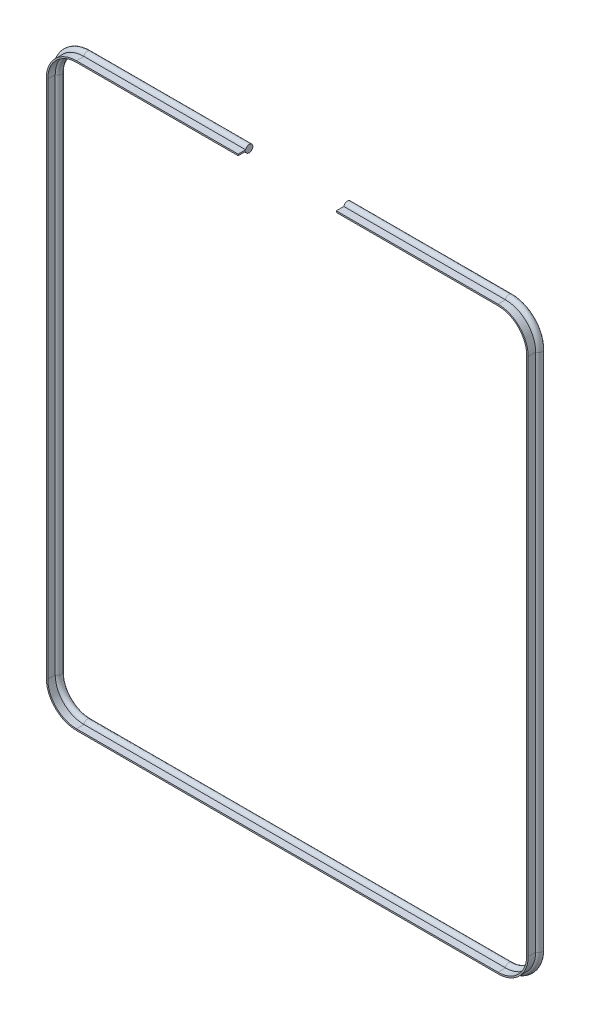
ISO-10303-21;
HEADER;
FILE_DESCRIPTION(('STEP AP214'),'2;1');
FILE_NAME('part.step','',(''),(''),'','','');
FILE_SCHEMA(('AUTOMOTIVE_DESIGN { 1 0 10303 214 1 1 1 1 }'));
ENDSEC;
DATA;
#1=APPLICATION_CONTEXT('core data for automotive mechanical design processes');
#2=APPLICATION_PROTOCOL_DEFINITION('international standard','automotive_design',2000,#1);
#3=PRODUCT_CONTEXT('',#1,'mechanical');
#4=PRODUCT('Part','Part','',(#3));
#5=PRODUCT_RELATED_PRODUCT_CATEGORY('part','',(#4));
#6=PRODUCT_DEFINITION_FORMATION('','',#4);
#7=PRODUCT_DEFINITION_CONTEXT('part definition',#1,'design');
#8=PRODUCT_DEFINITION('design','',#6,#7);
#9=PRODUCT_DEFINITION_SHAPE('','',#8);
#10=(LENGTH_UNIT() NAMED_UNIT(*) SI_UNIT(.MILLI.,.METRE.));
#11=(NAMED_UNIT(*) PLANE_ANGLE_UNIT() SI_UNIT($,.RADIAN.));
#12=(NAMED_UNIT(*) SI_UNIT($,.STERADIAN.) SOLID_ANGLE_UNIT());
#13=UNCERTAINTY_MEASURE_WITH_UNIT(LENGTH_MEASURE(1.E-05),#10,'distance_accuracy_value','');
#14=(GEOMETRIC_REPRESENTATION_CONTEXT(3) GLOBAL_UNCERTAINTY_ASSIGNED_CONTEXT((#13)) GLOBAL_UNIT_ASSIGNED_CONTEXT((#10,
#11,#12)) REPRESENTATION_CONTEXT('',''));
#15=CARTESIAN_POINT('',(0.,0.,0.));
#16=DIRECTION('',(0.,0.,1.));
#17=DIRECTION('',(1.,0.,0.));
#18=AXIS2_PLACEMENT_3D('',#15,#16,#17);
#19=CARTESIAN_POINT('',(429.5,-9.00000000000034,30.));
#20=DIRECTION('',(0.,-1.,0.));
#21=DIRECTION('',(1.,0.,0.));
#22=AXIS2_PLACEMENT_3D('',#19,#20,#21);
#23=PLANE('',#22);
#24=DIRECTION('',(0.,0.,1.));
#25=VECTOR('',#24,1.);
#26=CARTESIAN_POINT('',(429.5,-9.00000000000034,30.));
#27=LINE('',#26,#25);
#28=CARTESIAN_POINT('',(429.5,-9.00000000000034,14.8484692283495));
#29=VERTEX_POINT('',#28);
#30=CARTESIAN_POINT('',(429.5,-9.00000000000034,30.));
#31=VERTEX_POINT('',#30);
#32=EDGE_CURVE('E328',#29,#31,#27,.T.);
#33=ORIENTED_EDGE('',*,*,#32,.F.);
#34=DIRECTION('',(-1.,0.,0.));
#35=VECTOR('',#34,1.);
#36=CARTESIAN_POINT('',(429.5,-9.00000000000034,14.8484692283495));
#37=LINE('',#36,#35);
#38=CARTESIAN_POINT('',(100.,-9.00000000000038,14.8484692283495));
#39=VERTEX_POINT('',#38);
#40=EDGE_CURVE('E38',#29,#39,#37,.T.);
#41=ORIENTED_EDGE('',*,*,#40,.T.);
#42=DIRECTION('',(0.,0.,1.));
#43=VECTOR('',#42,1.);
#44=CARTESIAN_POINT('',(100.,-9.00000000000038,30.));
#45=LINE('',#44,#43);
#46=CARTESIAN_POINT('',(100.,-9.00000000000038,30.));
#47=VERTEX_POINT('',#46);
#48=EDGE_CURVE('E45',#39,#47,#45,.T.);
#49=ORIENTED_EDGE('',*,*,#48,.T.);
#50=DIRECTION('',(-1.,0.,0.));
#51=VECTOR('',#50,1.);
#52=CARTESIAN_POINT('',(429.5,-9.00000000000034,30.));
#53=LINE('',#52,#51);
#54=EDGE_CURVE('E11',#31,#47,#53,.T.);
#55=ORIENTED_EDGE('',*,*,#54,.F.);
#56=EDGE_LOOP('',(#33,#41,#49,#55));
#57=FACE_BOUND('',#56,.T.);
#58=ADVANCED_FACE('F31',(#57),#23,.F.);
#59=CARTESIAN_POINT('',(429.5,-10.5000000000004,7.5));
#60=DIRECTION('',(-1.,0.,0.));
#61=DIRECTION('',(0.,-1.,0.));
#62=AXIS2_PLACEMENT_3D('',#59,#60,#61);
#63=CYLINDRICAL_SURFACE('',#62,7.5);
#64=CARTESIAN_POINT('',(429.5,-10.5000000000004,7.5));
#65=DIRECTION('',(1.,0.,0.));
#66=DIRECTION('',(0.,0.,-1.));
#67=AXIS2_PLACEMENT_3D('',#64,#65,#66);
#68=CIRCLE('',#67,7.5);
#69=CARTESIAN_POINT('',(429.5,-12.0000000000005,14.8484692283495));
#70=VERTEX_POINT('',#69);
#71=EDGE_CURVE('E325',#70,#29,#68,.T.);
#72=ORIENTED_EDGE('',*,*,#71,.F.);
#73=DIRECTION('',(-1.,0.,0.));
#74=VECTOR('',#73,1.);
#75=CARTESIAN_POINT('',(429.5,-12.0000000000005,14.8484692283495));
#76=LINE('',#75,#74);
#77=CARTESIAN_POINT('',(100.,-12.0000000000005,14.8484692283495));
#78=VERTEX_POINT('',#77);
#79=EDGE_CURVE('E352',#70,#78,#76,.T.);
#80=ORIENTED_EDGE('',*,*,#79,.T.);
#81=CARTESIAN_POINT('',(100.,-10.5000000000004,7.5));
#82=DIRECTION('',(1.,0.,0.));
#83=DIRECTION('',(0.,0.,-1.));
#84=AXIS2_PLACEMENT_3D('',#81,#82,#83);
#85=CIRCLE('',#84,7.5);
#86=EDGE_CURVE('E53',#78,#39,#85,.T.);
#87=ORIENTED_EDGE('',*,*,#86,.T.);
#88=ORIENTED_EDGE('',*,*,#40,.F.);
#89=EDGE_LOOP('',(#72,#80,#87,#88));
#90=FACE_BOUND('',#89,.T.);
#91=ADVANCED_FACE('F355',(#90),#63,.T.);
#92=CARTESIAN_POINT('',(429.5,-12.0000000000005,30.));
#93=DIRECTION('',(0.,1.,0.));
#94=DIRECTION('',(-1.,0.,0.));
#95=AXIS2_PLACEMENT_3D('',#92,#93,#94);
#96=PLANE('',#95);
#97=DIRECTION('',(0.,0.,-1.));
#98=VECTOR('',#97,1.);
#99=CARTESIAN_POINT('',(429.5,-12.0000000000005,30.));
#100=LINE('',#99,#98);
#101=CARTESIAN_POINT('',(429.5,-12.0000000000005,30.));
#102=VERTEX_POINT('',#101);
#103=EDGE_CURVE('E322',#102,#70,#100,.T.);
#104=ORIENTED_EDGE('',*,*,#103,.F.);
#105=DIRECTION('',(-1.,0.,0.));
#106=VECTOR('',#105,1.);
#107=CARTESIAN_POINT('',(429.5,-12.0000000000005,30.));
#108=LINE('',#107,#106);
#109=CARTESIAN_POINT('',(100.,-12.0000000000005,30.));
#110=VERTEX_POINT('',#109);
#111=EDGE_CURVE('E349',#102,#110,#108,.T.);
#112=ORIENTED_EDGE('',*,*,#111,.T.);
#113=DIRECTION('',(0.,0.,-1.));
#114=VECTOR('',#113,1.);
#115=CARTESIAN_POINT('',(100.,-12.0000000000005,30.));
#116=LINE('',#115,#114);
#117=EDGE_CURVE('E345',#110,#78,#116,.T.);
#118=ORIENTED_EDGE('',*,*,#117,.T.);
#119=ORIENTED_EDGE('',*,*,#79,.F.);
#120=EDGE_LOOP('',(#104,#112,#118,#119));
#121=FACE_BOUND('',#120,.T.);
#122=ADVANCED_FACE('F439',(#121),#96,.F.);
#123=CARTESIAN_POINT('',(429.5,-70.5,7.5));
#124=DIRECTION('',(0.,0.,1.));
#125=DIRECTION('',(1.,0.,0.));
#126=AXIS2_PLACEMENT_3D('',#123,#124,#125);
#127=CYLINDRICAL_SURFACE('',#126,61.4999999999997);
#128=DIRECTION('',(0.,0.,1.));
#129=VECTOR('',#128,1.);
#130=CARTESIAN_POINT('',(491.,-70.5,30.));
#131=LINE('',#130,#129);
#132=CARTESIAN_POINT('',(491.,-70.5,14.8484692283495));
#133=VERTEX_POINT('',#132);
#134=CARTESIAN_POINT('',(491.,-70.5,30.));
#135=VERTEX_POINT('',#134);
#136=EDGE_CURVE('E307',#133,#135,#131,.T.);
#137=ORIENTED_EDGE('',*,*,#136,.F.);
#138=CARTESIAN_POINT('',(429.5,-70.5,14.8484692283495));
#139=DIRECTION('',(0.,0.,1.));
#140=DIRECTION('',(1.,0.,0.));
#141=AXIS2_PLACEMENT_3D('',#138,#139,#140);
#142=CIRCLE('',#141,61.4999999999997);
#143=EDGE_CURVE('E337',#133,#29,#142,.T.);
#144=ORIENTED_EDGE('',*,*,#143,.T.);
#145=ORIENTED_EDGE('',*,*,#32,.T.);
#146=CARTESIAN_POINT('',(429.5,-70.5,30.));
#147=DIRECTION('',(0.,0.,1.));
#148=DIRECTION('',(1.,0.,0.));
#149=AXIS2_PLACEMENT_3D('',#146,#147,#148);
#150=CIRCLE('',#149,61.4999999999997);
#151=EDGE_CURVE('E340',#135,#31,#150,.T.);
#152=ORIENTED_EDGE('',*,*,#151,.F.);
#153=EDGE_LOOP('',(#137,#144,#145,#152));
#154=FACE_BOUND('',#153,.T.);
#155=ADVANCED_FACE('F437',(#154),#127,.T.);
#156=CARTESIAN_POINT('',(429.5,-70.5,7.5));
#157=DIRECTION('',(0.,0.,1.));
#158=DIRECTION('',(1.,0.,0.));
#159=AXIS2_PLACEMENT_3D('',#156,#157,#158);
#160=TOROIDAL_SURFACE('',#159,59.9999999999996,7.5);
#161=CARTESIAN_POINT('',(489.5,-70.5,7.5));
#162=DIRECTION('',(0.,-1.,0.));
#163=DIRECTION('',(0.,0.,-1.));
#164=AXIS2_PLACEMENT_3D('',#161,#162,#163);
#165=CIRCLE('',#164,7.5);
#166=CARTESIAN_POINT('',(488.,-70.5,14.8484692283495));
#167=VERTEX_POINT('',#166);
#168=EDGE_CURVE('E304',#167,#133,#165,.T.);
#169=ORIENTED_EDGE('',*,*,#168,.F.);
#170=CARTESIAN_POINT('',(429.5,-70.5,14.8484692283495));
#171=DIRECTION('',(0.,0.,1.));
#172=DIRECTION('',(1.,0.,0.));
#173=AXIS2_PLACEMENT_3D('',#170,#171,#172);
#174=CIRCLE('',#173,58.4999999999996);
#175=EDGE_CURVE('E334',#167,#70,#174,.T.);
#176=ORIENTED_EDGE('',*,*,#175,.T.);
#177=ORIENTED_EDGE('',*,*,#71,.T.);
#178=ORIENTED_EDGE('',*,*,#143,.F.);
#179=EDGE_LOOP('',(#169,#176,#177,#178));
#180=FACE_BOUND('',#179,.T.);
#181=ADVANCED_FACE('F363',(#180),#160,.T.);
#182=CARTESIAN_POINT('',(429.5,-70.5,7.5));
#183=DIRECTION('',(0.,0.,1.));
#184=DIRECTION('',(1.,0.,0.));
#185=AXIS2_PLACEMENT_3D('',#182,#183,#184);
#186=CYLINDRICAL_SURFACE('',#185,58.4999999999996);
#187=DIRECTION('',(0.,0.,-1.));
#188=VECTOR('',#187,1.);
#189=CARTESIAN_POINT('',(488.,-70.5,30.));
#190=LINE('',#189,#188);
#191=CARTESIAN_POINT('',(488.,-70.5,30.));
#192=VERTEX_POINT('',#191);
#193=EDGE_CURVE('E301',#192,#167,#190,.T.);
#194=ORIENTED_EDGE('',*,*,#193,.F.);
#195=CARTESIAN_POINT('',(429.5,-70.5,30.));
#196=DIRECTION('',(0.,0.,1.));
#197=DIRECTION('',(1.,0.,0.));
#198=AXIS2_PLACEMENT_3D('',#195,#196,#197);
#199=CIRCLE('',#198,58.4999999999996);
#200=EDGE_CURVE('E331',#192,#102,#199,.T.);
#201=ORIENTED_EDGE('',*,*,#200,.T.);
#202=ORIENTED_EDGE('',*,*,#103,.T.);
#203=ORIENTED_EDGE('',*,*,#175,.F.);
#204=EDGE_LOOP('',(#194,#201,#202,#203));
#205=FACE_BOUND('',#204,.T.);
#206=ADVANCED_FACE('F360',(#205),#186,.F.);
#207=CARTESIAN_POINT('',(491.,-1129.5,30.));
#208=DIRECTION('',(-1.,0.,0.));
#209=DIRECTION('',(0.,0.,1.));
#210=AXIS2_PLACEMENT_3D('',#207,#208,#209);
#211=PLANE('',#210);
#212=DIRECTION('',(0.,0.,1.));
#213=VECTOR('',#212,1.);
#214=CARTESIAN_POINT('',(491.,-1129.5,30.));
#215=LINE('',#214,#213);
#216=CARTESIAN_POINT('',(491.,-1129.5,14.8484692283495));
#217=VERTEX_POINT('',#216);
#218=CARTESIAN_POINT('',(491.,-1129.5,30.));
#219=VERTEX_POINT('',#218);
#220=EDGE_CURVE('E286',#217,#219,#215,.T.);
#221=ORIENTED_EDGE('',*,*,#220,.F.);
#222=DIRECTION('',(0.,1.,0.));
#223=VECTOR('',#222,1.);
#224=CARTESIAN_POINT('',(491.,-1129.5,14.8484692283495));
#225=LINE('',#224,#223);
#226=EDGE_CURVE('E316',#217,#133,#225,.T.);
#227=ORIENTED_EDGE('',*,*,#226,.T.);
#228=ORIENTED_EDGE('',*,*,#136,.T.);
#229=DIRECTION('',(0.,1.,0.));
#230=VECTOR('',#229,1.);
#231=CARTESIAN_POINT('',(491.,-1129.5,30.));
#232=LINE('',#231,#230);
#233=EDGE_CURVE('E319',#219,#135,#232,.T.);
#234=ORIENTED_EDGE('',*,*,#233,.F.);
#235=EDGE_LOOP('',(#221,#227,#228,#234));
#236=FACE_BOUND('',#235,.T.);
#237=ADVANCED_FACE('F435',(#236),#211,.F.);
#238=CARTESIAN_POINT('',(489.5,-1129.5,7.5));
#239=DIRECTION('',(0.,1.,0.));
#240=DIRECTION('',(0.,0.,1.));
#241=AXIS2_PLACEMENT_3D('',#238,#239,#240);
#242=CYLINDRICAL_SURFACE('',#241,7.5);
#243=CARTESIAN_POINT('',(489.5,-1129.5,7.5));
#244=DIRECTION('',(0.,-1.,0.));
#245=DIRECTION('',(0.,0.,-1.));
#246=AXIS2_PLACEMENT_3D('',#243,#244,#245);
#247=CIRCLE('',#246,7.5);
#248=CARTESIAN_POINT('',(488.,-1129.5,14.8484692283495));
#249=VERTEX_POINT('',#248);
#250=EDGE_CURVE('E283',#249,#217,#247,.T.);
#251=ORIENTED_EDGE('',*,*,#250,.F.);
#252=DIRECTION('',(0.,1.,0.));
#253=VECTOR('',#252,1.);
#254=CARTESIAN_POINT('',(488.,-1129.5,14.8484692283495));
#255=LINE('',#254,#253);
#256=EDGE_CURVE('E313',#249,#167,#255,.T.);
#257=ORIENTED_EDGE('',*,*,#256,.T.);
#258=ORIENTED_EDGE('',*,*,#168,.T.);
#259=ORIENTED_EDGE('',*,*,#226,.F.);
#260=EDGE_LOOP('',(#251,#257,#258,#259));
#261=FACE_BOUND('',#260,.T.);
#262=ADVANCED_FACE('F370',(#261),#242,.T.);
#263=CARTESIAN_POINT('',(488.,-1129.5,30.));
#264=DIRECTION('',(1.,0.,0.));
#265=DIRECTION('',(0.,0.,-1.));
#266=AXIS2_PLACEMENT_3D('',#263,#264,#265);
#267=PLANE('',#266);
#268=DIRECTION('',(0.,0.,-1.));
#269=VECTOR('',#268,1.);
#270=CARTESIAN_POINT('',(488.,-1129.5,30.));
#271=LINE('',#270,#269);
#272=CARTESIAN_POINT('',(488.,-1129.5,30.));
#273=VERTEX_POINT('',#272);
#274=EDGE_CURVE('E280',#273,#249,#271,.T.);
#275=ORIENTED_EDGE('',*,*,#274,.F.);
#276=DIRECTION('',(0.,1.,0.));
#277=VECTOR('',#276,1.);
#278=CARTESIAN_POINT('',(488.,-1129.5,30.));
#279=LINE('',#278,#277);
#280=EDGE_CURVE('E310',#273,#192,#279,.T.);
#281=ORIENTED_EDGE('',*,*,#280,.T.);
#282=ORIENTED_EDGE('',*,*,#193,.T.);
#283=ORIENTED_EDGE('',*,*,#256,.F.);
#284=EDGE_LOOP('',(#275,#281,#282,#283));
#285=FACE_BOUND('',#284,.T.);
#286=ADVANCED_FACE('F368',(#285),#267,.F.);
#287=CARTESIAN_POINT('',(429.5,-1129.5,7.5));
#288=DIRECTION('',(0.,0.,1.));
#289=DIRECTION('',(1.,0.,0.));
#290=AXIS2_PLACEMENT_3D('',#287,#288,#289);
#291=CYLINDRICAL_SURFACE('',#290,61.4999999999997);
#292=DIRECTION('',(0.,0.,1.));
#293=VECTOR('',#292,1.);
#294=CARTESIAN_POINT('',(429.5,-1191.,30.));
#295=LINE('',#294,#293);
#296=CARTESIAN_POINT('',(429.5,-1191.,14.8484692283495));
#297=VERTEX_POINT('',#296);
#298=CARTESIAN_POINT('',(429.5,-1191.,30.));
#299=VERTEX_POINT('',#298);
#300=EDGE_CURVE('E265',#297,#299,#295,.T.);
#301=ORIENTED_EDGE('',*,*,#300,.F.);
#302=CARTESIAN_POINT('',(429.5,-1129.5,14.8484692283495));
#303=DIRECTION('',(0.,0.,1.));
#304=DIRECTION('',(1.,0.,0.));
#305=AXIS2_PLACEMENT_3D('',#302,#303,#304);
#306=CIRCLE('',#305,61.4999999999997);
#307=EDGE_CURVE('E295',#297,#217,#306,.T.);
#308=ORIENTED_EDGE('',*,*,#307,.T.);
#309=ORIENTED_EDGE('',*,*,#220,.T.);
#310=CARTESIAN_POINT('',(429.5,-1129.5,30.));
#311=DIRECTION('',(0.,0.,1.));
#312=DIRECTION('',(1.,0.,0.));
#313=AXIS2_PLACEMENT_3D('',#310,#311,#312);
#314=CIRCLE('',#313,61.4999999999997);
#315=EDGE_CURVE('E298',#299,#219,#314,.T.);
#316=ORIENTED_EDGE('',*,*,#315,.F.);
#317=EDGE_LOOP('',(#301,#308,#309,#316));
#318=FACE_BOUND('',#317,.T.);
#319=ADVANCED_FACE('F433',(#318),#291,.T.);
#320=CARTESIAN_POINT('',(429.5,-1129.5,7.5));
#321=DIRECTION('',(0.,0.,1.));
#322=DIRECTION('',(1.,0.,0.));
#323=AXIS2_PLACEMENT_3D('',#320,#321,#322);
#324=TOROIDAL_SURFACE('',#323,59.9999999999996,7.5);
#325=CARTESIAN_POINT('',(429.5,-1189.5,7.5));
#326=DIRECTION('',(-1.,0.,0.));
#327=DIRECTION('',(0.,0.,-1.));
#328=AXIS2_PLACEMENT_3D('',#325,#326,#327);
#329=CIRCLE('',#328,7.5);
#330=CARTESIAN_POINT('',(429.5,-1188.,14.8484692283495));
#331=VERTEX_POINT('',#330);
#332=EDGE_CURVE('E262',#331,#297,#329,.T.);
#333=ORIENTED_EDGE('',*,*,#332,.F.);
#334=CARTESIAN_POINT('',(429.5,-1129.5,14.8484692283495));
#335=DIRECTION('',(0.,0.,1.));
#336=DIRECTION('',(1.,0.,0.));
#337=AXIS2_PLACEMENT_3D('',#334,#335,#336);
#338=CIRCLE('',#337,58.4999999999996);
#339=EDGE_CURVE('E292',#331,#249,#338,.T.);
#340=ORIENTED_EDGE('',*,*,#339,.T.);
#341=ORIENTED_EDGE('',*,*,#250,.T.);
#342=ORIENTED_EDGE('',*,*,#307,.F.);
#343=EDGE_LOOP('',(#333,#340,#341,#342));
#344=FACE_BOUND('',#343,.T.);
#345=ADVANCED_FACE('F377',(#344),#324,.T.);
#346=CARTESIAN_POINT('',(429.5,-1129.5,7.5));
#347=DIRECTION('',(0.,0.,1.));
#348=DIRECTION('',(1.,0.,0.));
#349=AXIS2_PLACEMENT_3D('',#346,#347,#348);
#350=CYLINDRICAL_SURFACE('',#349,58.4999999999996);
#351=DIRECTION('',(0.,0.,-1.));
#352=VECTOR('',#351,1.);
#353=CARTESIAN_POINT('',(429.5,-1188.,30.));
#354=LINE('',#353,#352);
#355=CARTESIAN_POINT('',(429.5,-1188.,30.));
#356=VERTEX_POINT('',#355);
#357=EDGE_CURVE('E259',#356,#331,#354,.T.);
#358=ORIENTED_EDGE('',*,*,#357,.F.);
#359=CARTESIAN_POINT('',(429.5,-1129.5,30.));
#360=DIRECTION('',(0.,0.,1.));
#361=DIRECTION('',(1.,0.,0.));
#362=AXIS2_PLACEMENT_3D('',#359,#360,#361);
#363=CIRCLE('',#362,58.4999999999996);
#364=EDGE_CURVE('E289',#356,#273,#363,.T.);
#365=ORIENTED_EDGE('',*,*,#364,.T.);
#366=ORIENTED_EDGE('',*,*,#274,.T.);
#367=ORIENTED_EDGE('',*,*,#339,.F.);
#368=EDGE_LOOP('',(#358,#365,#366,#367));
#369=FACE_BOUND('',#368,.T.);
#370=ADVANCED_FACE('F375',(#369),#350,.F.);
#371=CARTESIAN_POINT('',(-429.5,-1191.,30.));
#372=DIRECTION('',(0.,1.,0.));
#373=DIRECTION('',(-1.,0.,0.));
#374=AXIS2_PLACEMENT_3D('',#371,#372,#373);
#375=PLANE('',#374);
#376=DIRECTION('',(0.,0.,1.));
#377=VECTOR('',#376,1.);
#378=CARTESIAN_POINT('',(-429.5,-1191.,30.));
#379=LINE('',#378,#377);
#380=CARTESIAN_POINT('',(-429.5,-1191.,14.8484692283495));
#381=VERTEX_POINT('',#380);
#382=CARTESIAN_POINT('',(-429.5,-1191.,30.));
#383=VERTEX_POINT('',#382);
#384=EDGE_CURVE('E244',#381,#383,#379,.T.);
#385=ORIENTED_EDGE('',*,*,#384,.F.);
#386=DIRECTION('',(1.,0.,0.));
#387=VECTOR('',#386,1.);
#388=CARTESIAN_POINT('',(-429.5,-1191.,14.8484692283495));
#389=LINE('',#388,#387);
#390=EDGE_CURVE('E274',#381,#297,#389,.T.);
#391=ORIENTED_EDGE('',*,*,#390,.T.);
#392=ORIENTED_EDGE('',*,*,#300,.T.);
#393=DIRECTION('',(1.,0.,0.));
#394=VECTOR('',#393,1.);
#395=CARTESIAN_POINT('',(-429.5,-1191.,30.));
#396=LINE('',#395,#394);
#397=EDGE_CURVE('E277',#383,#299,#396,.T.);
#398=ORIENTED_EDGE('',*,*,#397,.F.);
#399=EDGE_LOOP('',(#385,#391,#392,#398));
#400=FACE_BOUND('',#399,.T.);
#401=ADVANCED_FACE('F431',(#400),#375,.F.);
#402=CARTESIAN_POINT('',(-429.5,-1189.5,7.5));
#403=DIRECTION('',(1.,0.,0.));
#404=DIRECTION('',(0.,1.,0.));
#405=AXIS2_PLACEMENT_3D('',#402,#403,#404);
#406=CYLINDRICAL_SURFACE('',#405,7.5);
#407=CARTESIAN_POINT('',(-429.5,-1189.5,7.5));
#408=DIRECTION('',(-1.,0.,0.));
#409=DIRECTION('',(0.,0.,-1.));
#410=AXIS2_PLACEMENT_3D('',#407,#408,#409);
#411=CIRCLE('',#410,7.5);
#412=CARTESIAN_POINT('',(-429.5,-1188.,14.8484692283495));
#413=VERTEX_POINT('',#412);
#414=EDGE_CURVE('E241',#413,#381,#411,.T.);
#415=ORIENTED_EDGE('',*,*,#414,.F.);
#416=DIRECTION('',(1.,0.,0.));
#417=VECTOR('',#416,1.);
#418=CARTESIAN_POINT('',(-429.5,-1188.,14.8484692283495));
#419=LINE('',#418,#417);
#420=EDGE_CURVE('E271',#413,#331,#419,.T.);
#421=ORIENTED_EDGE('',*,*,#420,.T.);
#422=ORIENTED_EDGE('',*,*,#332,.T.);
#423=ORIENTED_EDGE('',*,*,#390,.F.);
#424=EDGE_LOOP('',(#415,#421,#422,#423));
#425=FACE_BOUND('',#424,.T.);
#426=ADVANCED_FACE('F384',(#425),#406,.T.);
#427=CARTESIAN_POINT('',(-429.5,-1188.,30.));
#428=DIRECTION('',(0.,-1.,0.));
#429=DIRECTION('',(1.,0.,0.));
#430=AXIS2_PLACEMENT_3D('',#427,#428,#429);
#431=PLANE('',#430);
#432=DIRECTION('',(0.,0.,-1.));
#433=VECTOR('',#432,1.);
#434=CARTESIAN_POINT('',(-429.5,-1188.,30.));
#435=LINE('',#434,#433);
#436=CARTESIAN_POINT('',(-429.5,-1188.,30.));
#437=VERTEX_POINT('',#436);
#438=EDGE_CURVE('E238',#437,#413,#435,.T.);
#439=ORIENTED_EDGE('',*,*,#438,.F.);
#440=DIRECTION('',(1.,0.,0.));
#441=VECTOR('',#440,1.);
#442=CARTESIAN_POINT('',(-429.5,-1188.,30.));
#443=LINE('',#442,#441);
#444=EDGE_CURVE('E268',#437,#356,#443,.T.);
#445=ORIENTED_EDGE('',*,*,#444,.T.);
#446=ORIENTED_EDGE('',*,*,#357,.T.);
#447=ORIENTED_EDGE('',*,*,#420,.F.);
#448=EDGE_LOOP('',(#439,#445,#446,#447));
#449=FACE_BOUND('',#448,.T.);
#450=ADVANCED_FACE('F382',(#449),#431,.F.);
#451=CARTESIAN_POINT('',(-429.5,-1129.5,7.5));
#452=DIRECTION('',(0.,0.,1.));
#453=DIRECTION('',(1.,0.,0.));
#454=AXIS2_PLACEMENT_3D('',#451,#452,#453);
#455=CYLINDRICAL_SURFACE('',#454,61.5);
#456=DIRECTION('',(0.,0.,1.));
#457=VECTOR('',#456,1.);
#458=CARTESIAN_POINT('',(-491.,-1129.5,30.));
#459=LINE('',#458,#457);
#460=CARTESIAN_POINT('',(-491.,-1129.5,14.8484692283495));
#461=VERTEX_POINT('',#460);
#462=CARTESIAN_POINT('',(-491.,-1129.5,30.));
#463=VERTEX_POINT('',#462);
#464=EDGE_CURVE('E225',#461,#463,#459,.T.);
#465=ORIENTED_EDGE('',*,*,#464,.F.);
#466=CARTESIAN_POINT('',(-429.5,-1129.5,14.8484692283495));
#467=DIRECTION('',(0.,0.,1.));
#468=DIRECTION('',(1.,0.,0.));
#469=AXIS2_PLACEMENT_3D('',#466,#467,#468);
#470=CIRCLE('',#469,61.5);
#471=EDGE_CURVE('E253',#461,#381,#470,.T.);
#472=ORIENTED_EDGE('',*,*,#471,.T.);
#473=ORIENTED_EDGE('',*,*,#384,.T.);
#474=CARTESIAN_POINT('',(-429.5,-1129.5,30.));
#475=DIRECTION('',(0.,0.,1.));
#476=DIRECTION('',(1.,0.,0.));
#477=AXIS2_PLACEMENT_3D('',#474,#475,#476);
#478=CIRCLE('',#477,61.5);
#479=EDGE_CURVE('E256',#463,#383,#478,.T.);
#480=ORIENTED_EDGE('',*,*,#479,.F.);
#481=EDGE_LOOP('',(#465,#472,#473,#480));
#482=FACE_BOUND('',#481,.T.);
#483=ADVANCED_FACE('F429',(#482),#455,.T.);
#484=CARTESIAN_POINT('',(-429.5,-1129.5,7.5));
#485=DIRECTION('',(0.,0.,1.));
#486=DIRECTION('',(1.,0.,0.));
#487=AXIS2_PLACEMENT_3D('',#484,#485,#486);
#488=TOROIDAL_SURFACE('',#487,60.,7.5);
#489=CARTESIAN_POINT('',(-489.5,-1129.5,7.5));
#490=DIRECTION('',(0.,1.,0.));
#491=DIRECTION('',(0.,0.,-1.));
#492=AXIS2_PLACEMENT_3D('',#489,#490,#491);
#493=CIRCLE('',#492,7.5);
#494=CARTESIAN_POINT('',(-488.,-1129.5,14.8484692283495));
#495=VERTEX_POINT('',#494);
#496=EDGE_CURVE('E222',#495,#461,#493,.T.);
#497=ORIENTED_EDGE('',*,*,#496,.F.);
#498=CARTESIAN_POINT('',(-429.5,-1129.5,14.8484692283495));
#499=DIRECTION('',(0.,0.,1.));
#500=DIRECTION('',(1.,0.,0.));
#501=AXIS2_PLACEMENT_3D('',#498,#499,#500);
#502=CIRCLE('',#501,58.5);
#503=EDGE_CURVE('E250',#495,#413,#502,.T.);
#504=ORIENTED_EDGE('',*,*,#503,.T.);
#505=ORIENTED_EDGE('',*,*,#414,.T.);
#506=ORIENTED_EDGE('',*,*,#471,.F.);
#507=EDGE_LOOP('',(#497,#504,#505,#506));
#508=FACE_BOUND('',#507,.T.);
#509=ADVANCED_FACE('F391',(#508),#488,.T.);
#510=CARTESIAN_POINT('',(-429.5,-1129.5,7.5));
#511=DIRECTION('',(0.,0.,1.));
#512=DIRECTION('',(1.,0.,0.));
#513=AXIS2_PLACEMENT_3D('',#510,#511,#512);
#514=CYLINDRICAL_SURFACE('',#513,58.5);
#515=DIRECTION('',(0.,0.,-1.));
#516=VECTOR('',#515,1.);
#517=CARTESIAN_POINT('',(-488.,-1129.5,30.));
#518=LINE('',#517,#516);
#519=CARTESIAN_POINT('',(-488.,-1129.5,30.));
#520=VERTEX_POINT('',#519);
#521=EDGE_CURVE('E219',#520,#495,#518,.T.);
#522=ORIENTED_EDGE('',*,*,#521,.F.);
#523=CARTESIAN_POINT('',(-429.5,-1129.5,30.));
#524=DIRECTION('',(0.,0.,1.));
#525=DIRECTION('',(1.,0.,0.));
#526=AXIS2_PLACEMENT_3D('',#523,#524,#525);
#527=CIRCLE('',#526,58.5);
#528=EDGE_CURVE('E247',#520,#437,#527,.T.);
#529=ORIENTED_EDGE('',*,*,#528,.T.);
#530=ORIENTED_EDGE('',*,*,#438,.T.);
#531=ORIENTED_EDGE('',*,*,#503,.F.);
#532=EDGE_LOOP('',(#522,#529,#530,#531));
#533=FACE_BOUND('',#532,.T.);
#534=ADVANCED_FACE('F389',(#533),#514,.F.);
#535=CARTESIAN_POINT('',(-491.,-70.5000000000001,30.));
#536=DIRECTION('',(1.,0.,0.));
#537=DIRECTION('',(0.,1.,0.));
#538=AXIS2_PLACEMENT_3D('',#535,#536,#537);
#539=PLANE('',#538);
#540=DIRECTION('',(0.,0.,1.));
#541=VECTOR('',#540,1.);
#542=CARTESIAN_POINT('',(-491.,-70.5000000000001,30.));
#543=LINE('',#542,#541);
#544=CARTESIAN_POINT('',(-491.,-70.5000000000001,14.8484692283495));
#545=VERTEX_POINT('',#544);
#546=CARTESIAN_POINT('',(-491.,-70.5000000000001,30.));
#547=VERTEX_POINT('',#546);
#548=EDGE_CURVE('E180',#545,#547,#543,.T.);
#549=ORIENTED_EDGE('',*,*,#548,.F.);
#550=DIRECTION('',(0.,-1.,0.));
#551=VECTOR('',#550,1.);
#552=CARTESIAN_POINT('',(-491.,-70.5000000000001,14.8484692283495));
#553=LINE('',#552,#551);
#554=EDGE_CURVE('E232',#545,#461,#553,.T.);
#555=ORIENTED_EDGE('',*,*,#554,.T.);
#556=ORIENTED_EDGE('',*,*,#464,.T.);
#557=DIRECTION('',(0.,-1.,0.));
#558=VECTOR('',#557,1.);
#559=CARTESIAN_POINT('',(-491.,-70.5000000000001,30.));
#560=LINE('',#559,#558);
#561=EDGE_CURVE('E235',#547,#463,#560,.T.);
#562=ORIENTED_EDGE('',*,*,#561,.F.);
#563=EDGE_LOOP('',(#549,#555,#556,#562));
#564=FACE_BOUND('',#563,.T.);
#565=ADVANCED_FACE('F427',(#564),#539,.F.);
#566=CARTESIAN_POINT('',(-489.5,-70.5000000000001,7.5));
#567=DIRECTION('',(0.,-1.,0.));
#568=DIRECTION('',(1.,0.,0.));
#569=AXIS2_PLACEMENT_3D('',#566,#567,#568);
#570=CYLINDRICAL_SURFACE('',#569,7.5);
#571=CARTESIAN_POINT('',(-489.5,-70.5000000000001,7.5));
#572=DIRECTION('',(0.,1.,0.));
#573=DIRECTION('',(0.,0.,-1.));
#574=AXIS2_PLACEMENT_3D('',#571,#572,#573);
#575=CIRCLE('',#574,7.5);
#576=CARTESIAN_POINT('',(-488.,-70.5000000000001,14.8484692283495));
#577=VERTEX_POINT('',#576);
#578=EDGE_CURVE('E206',#577,#545,#575,.T.);
#579=ORIENTED_EDGE('',*,*,#578,.F.);
#580=DIRECTION('',(0.,-1.,0.));
#581=VECTOR('',#580,1.);
#582=CARTESIAN_POINT('',(-488.,-70.5000000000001,14.8484692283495));
#583=LINE('',#582,#581);
#584=EDGE_CURVE('E229',#577,#495,#583,.T.);
#585=ORIENTED_EDGE('',*,*,#584,.T.);
#586=ORIENTED_EDGE('',*,*,#496,.T.);
#587=ORIENTED_EDGE('',*,*,#554,.F.);
#588=EDGE_LOOP('',(#579,#585,#586,#587));
#589=FACE_BOUND('',#588,.T.);
#590=ADVANCED_FACE('F397',(#589),#570,.T.);
#591=CARTESIAN_POINT('',(-488.,-70.5000000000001,30.));
#592=DIRECTION('',(-1.,0.,0.));
#593=DIRECTION('',(0.,0.,1.));
#594=AXIS2_PLACEMENT_3D('',#591,#592,#593);
#595=PLANE('',#594);
#596=DIRECTION('',(0.,0.,-1.));
#597=VECTOR('',#596,1.);
#598=CARTESIAN_POINT('',(-488.,-70.5000000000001,30.));
#599=LINE('',#598,#597);
#600=CARTESIAN_POINT('',(-488.,-70.5000000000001,30.));
#601=VERTEX_POINT('',#600);
#602=EDGE_CURVE('E204',#601,#577,#599,.T.);
#603=ORIENTED_EDGE('',*,*,#602,.F.);
#604=DIRECTION('',(0.,-1.,0.));
#605=VECTOR('',#604,1.);
#606=CARTESIAN_POINT('',(-488.,-70.5000000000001,30.));
#607=LINE('',#606,#605);
#608=EDGE_CURVE('E175',#601,#520,#607,.T.);
#609=ORIENTED_EDGE('',*,*,#608,.T.);
#610=ORIENTED_EDGE('',*,*,#521,.T.);
#611=ORIENTED_EDGE('',*,*,#584,.F.);
#612=EDGE_LOOP('',(#603,#609,#610,#611));
#613=FACE_BOUND('',#612,.T.);
#614=ADVANCED_FACE('F395',(#613),#595,.F.);
#615=CARTESIAN_POINT('',(-429.5,-70.5000000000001,7.5));
#616=DIRECTION('',(0.,0.,1.));
#617=DIRECTION('',(1.,0.,0.));
#618=AXIS2_PLACEMENT_3D('',#615,#616,#617);
#619=CYLINDRICAL_SURFACE('',#618,61.5);
#620=DIRECTION('',(0.,0.,1.));
#621=VECTOR('',#620,1.);
#622=CARTESIAN_POINT('',(-429.5,-9.00000000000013,30.));
#623=LINE('',#622,#621);
#624=CARTESIAN_POINT('',(-429.5,-9.00000000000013,14.8484692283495));
#625=VERTEX_POINT('',#624);
#626=CARTESIAN_POINT('',(-429.5,-9.00000000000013,30.));
#627=VERTEX_POINT('',#626);
#628=EDGE_CURVE('E196',#625,#627,#623,.T.);
#629=ORIENTED_EDGE('',*,*,#628,.F.);
#630=CARTESIAN_POINT('',(-429.5,-70.5000000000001,14.8484692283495));
#631=DIRECTION('',(0.,0.,1.));
#632=DIRECTION('',(1.,0.,0.));
#633=AXIS2_PLACEMENT_3D('',#630,#631,#632);
#634=CIRCLE('',#633,61.5);
#635=EDGE_CURVE('E213',#625,#545,#634,.T.);
#636=ORIENTED_EDGE('',*,*,#635,.T.);
#637=ORIENTED_EDGE('',*,*,#548,.T.);
#638=CARTESIAN_POINT('',(-429.5,-70.5000000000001,30.));
#639=DIRECTION('',(0.,0.,1.));
#640=DIRECTION('',(1.,0.,0.));
#641=AXIS2_PLACEMENT_3D('',#638,#639,#640);
#642=CIRCLE('',#641,61.5);
#643=EDGE_CURVE('E216',#627,#547,#642,.T.);
#644=ORIENTED_EDGE('',*,*,#643,.F.);
#645=EDGE_LOOP('',(#629,#636,#637,#644));
#646=FACE_BOUND('',#645,.T.);
#647=ADVANCED_FACE('F425',(#646),#619,.T.);
#648=CARTESIAN_POINT('',(-429.5,-70.5000000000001,7.5));
#649=DIRECTION('',(0.,0.,1.));
#650=DIRECTION('',(1.,0.,0.));
#651=AXIS2_PLACEMENT_3D('',#648,#649,#650);
#652=TOROIDAL_SURFACE('',#651,60.,7.5);
#653=CARTESIAN_POINT('',(-429.5,-10.5000000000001,7.5));
#654=DIRECTION('',(1.,0.,0.));
#655=DIRECTION('',(0.,0.,-1.));
#656=AXIS2_PLACEMENT_3D('',#653,#654,#655);
#657=CIRCLE('',#656,7.5);
#658=CARTESIAN_POINT('',(-429.5,-12.0000000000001,14.8484692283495));
#659=VERTEX_POINT('',#658);
#660=EDGE_CURVE('E188',#659,#625,#657,.T.);
#661=ORIENTED_EDGE('',*,*,#660,.F.);
#662=CARTESIAN_POINT('',(-429.5,-70.5000000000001,14.8484692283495));
#663=DIRECTION('',(0.,0.,1.));
#664=DIRECTION('',(1.,0.,0.));
#665=AXIS2_PLACEMENT_3D('',#662,#663,#664);
#666=CIRCLE('',#665,58.5);
#667=EDGE_CURVE('E179',#659,#577,#666,.T.);
#668=ORIENTED_EDGE('',*,*,#667,.T.);
#669=ORIENTED_EDGE('',*,*,#578,.T.);
#670=ORIENTED_EDGE('',*,*,#635,.F.);
#671=EDGE_LOOP('',(#661,#668,#669,#670));
#672=FACE_BOUND('',#671,.T.);
#673=ADVANCED_FACE('F400',(#672),#652,.T.);
#674=CARTESIAN_POINT('',(-429.5,-70.5000000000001,7.5));
#675=DIRECTION('',(0.,0.,1.));
#676=DIRECTION('',(1.,0.,0.));
#677=AXIS2_PLACEMENT_3D('',#674,#675,#676);
#678=CYLINDRICAL_SURFACE('',#677,58.5);
#679=DIRECTION('',(0.,0.,-1.));
#680=VECTOR('',#679,1.);
#681=CARTESIAN_POINT('',(-429.5,-12.0000000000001,30.));
#682=LINE('',#681,#680);
#683=CARTESIAN_POINT('',(-429.5,-12.0000000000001,30.));
#684=VERTEX_POINT('',#683);
#685=EDGE_CURVE('E183',#684,#659,#682,.T.);
#686=ORIENTED_EDGE('',*,*,#685,.F.);
#687=CARTESIAN_POINT('',(-429.5,-70.5000000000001,30.));
#688=DIRECTION('',(0.,0.,1.));
#689=DIRECTION('',(1.,0.,0.));
#690=AXIS2_PLACEMENT_3D('',#687,#688,#689);
#691=CIRCLE('',#690,58.5);
#692=EDGE_CURVE('E167',#684,#601,#691,.T.);
#693=ORIENTED_EDGE('',*,*,#692,.T.);
#694=ORIENTED_EDGE('',*,*,#602,.T.);
#695=ORIENTED_EDGE('',*,*,#667,.F.);
#696=EDGE_LOOP('',(#686,#693,#694,#695));
#697=FACE_BOUND('',#696,.T.);
#698=ADVANCED_FACE('F184',(#697),#678,.F.);
#699=CARTESIAN_POINT('',(-429.5,-9.00000000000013,30.));
#700=DIRECTION('',(0.,0.,1.));
#701=DIRECTION('',(1.,0.,0.));
#702=AXIS2_PLACEMENT_3D('',#699,#700,#701);
#703=PLANE('',#702);
#704=DIRECTION('',(0.,-1.,0.));
#705=VECTOR('',#704,1.);
#706=CARTESIAN_POINT('',(-100.,-9.00000000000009,30.));
#707=LINE('',#706,#705);
#708=CARTESIAN_POINT('',(-100.,-9.00000000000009,30.));
#709=VERTEX_POINT('',#708);
#710=CARTESIAN_POINT('',(-100.,-12.0000000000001,30.));
#711=VERTEX_POINT('',#710);
#712=EDGE_CURVE('E416',#709,#711,#707,.T.);
#713=ORIENTED_EDGE('',*,*,#712,.F.);
#714=DIRECTION('',(1.,0.,0.));
#715=VECTOR('',#714,1.);
#716=CARTESIAN_POINT('',(-429.5,-9.00000000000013,30.));
#717=LINE('',#716,#715);
#718=EDGE_CURVE('E207',#627,#709,#717,.T.);
#719=ORIENTED_EDGE('',*,*,#718,.F.);
#720=ORIENTED_EDGE('',*,*,#643,.T.);
#721=ORIENTED_EDGE('',*,*,#561,.T.);
#722=ORIENTED_EDGE('',*,*,#479,.T.);
#723=ORIENTED_EDGE('',*,*,#397,.T.);
#724=ORIENTED_EDGE('',*,*,#315,.T.);
#725=ORIENTED_EDGE('',*,*,#233,.T.);
#726=ORIENTED_EDGE('',*,*,#151,.T.);
#727=ORIENTED_EDGE('',*,*,#54,.T.);
#728=DIRECTION('',(0.,-1.,0.));
#729=VECTOR('',#728,1.);
#730=CARTESIAN_POINT('',(100.,-9.00000000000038,30.));
#731=LINE('',#730,#729);
#732=EDGE_CURVE('E343',#47,#110,#731,.T.);
#733=ORIENTED_EDGE('',*,*,#732,.T.);
#734=ORIENTED_EDGE('',*,*,#111,.F.);
#735=ORIENTED_EDGE('',*,*,#200,.F.);
#736=ORIENTED_EDGE('',*,*,#280,.F.);
#737=ORIENTED_EDGE('',*,*,#364,.F.);
#738=ORIENTED_EDGE('',*,*,#444,.F.);
#739=ORIENTED_EDGE('',*,*,#528,.F.);
#740=ORIENTED_EDGE('',*,*,#608,.F.);
#741=ORIENTED_EDGE('',*,*,#692,.F.);
#742=DIRECTION('',(1.,0.,0.));
#743=VECTOR('',#742,1.);
#744=CARTESIAN_POINT('',(-429.5,-12.0000000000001,30.));
#745=LINE('',#744,#743);
#746=EDGE_CURVE('E172',#684,#711,#745,.T.);
#747=ORIENTED_EDGE('',*,*,#746,.T.);
#748=EDGE_LOOP('',(#713,#719,#720,#721,#722,#723,#724,#725,#726,#727,#733,#734,#735,#736,#737,
#738,#739,#740,#741,#747));
#749=FACE_BOUND('',#748,.T.);
#750=ADVANCED_FACE('F170',(#749),#703,.T.);
#751=CARTESIAN_POINT('',(-429.5,-9.00000000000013,30.));
#752=DIRECTION('',(0.,1.,0.));
#753=DIRECTION('',(-1.,0.,0.));
#754=AXIS2_PLACEMENT_3D('',#751,#752,#753);
#755=PLANE('',#754);
#756=DIRECTION('',(0.,0.,1.));
#757=VECTOR('',#756,1.);
#758=CARTESIAN_POINT('',(-100.,-9.00000000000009,30.));
#759=LINE('',#758,#757);
#760=CARTESIAN_POINT('',(-100.,-9.00000000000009,14.8484692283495));
#761=VERTEX_POINT('',#760);
#762=EDGE_CURVE('E189',#761,#709,#759,.T.);
#763=ORIENTED_EDGE('',*,*,#762,.F.);
#764=DIRECTION('',(1.,0.,0.));
#765=VECTOR('',#764,1.);
#766=CARTESIAN_POINT('',(-429.5,-9.00000000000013,14.8484692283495));
#767=LINE('',#766,#765);
#768=EDGE_CURVE('E198',#625,#761,#767,.T.);
#769=ORIENTED_EDGE('',*,*,#768,.F.);
#770=ORIENTED_EDGE('',*,*,#628,.T.);
#771=ORIENTED_EDGE('',*,*,#718,.T.);
#772=EDGE_LOOP('',(#763,#769,#770,#771));
#773=FACE_BOUND('',#772,.T.);
#774=ADVANCED_FACE('F423',(#773),#755,.T.);
#775=CARTESIAN_POINT('',(-429.5,-10.5000000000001,7.5));
#776=DIRECTION('',(1.,0.,0.));
#777=DIRECTION('',(0.,1.,0.));
#778=AXIS2_PLACEMENT_3D('',#775,#776,#777);
#779=CYLINDRICAL_SURFACE('',#778,7.5);
#780=CARTESIAN_POINT('',(-100.,-10.5000000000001,7.5));
#781=DIRECTION('',(1.,0.,0.));
#782=DIRECTION('',(0.,0.,-1.));
#783=AXIS2_PLACEMENT_3D('',#780,#781,#782);
#784=CIRCLE('',#783,7.5);
#785=CARTESIAN_POINT('',(-100.,-12.0000000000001,14.8484692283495));
#786=VERTEX_POINT('',#785);
#787=EDGE_CURVE('E409',#786,#761,#784,.T.);
#788=ORIENTED_EDGE('',*,*,#787,.F.);
#789=DIRECTION('',(1.,0.,0.));
#790=VECTOR('',#789,1.);
#791=CARTESIAN_POINT('',(-429.5,-12.0000000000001,14.8484692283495));
#792=LINE('',#791,#790);
#793=EDGE_CURVE('E195',#659,#786,#792,.T.);
#794=ORIENTED_EDGE('',*,*,#793,.F.);
#795=ORIENTED_EDGE('',*,*,#660,.T.);
#796=ORIENTED_EDGE('',*,*,#768,.T.);
#797=EDGE_LOOP('',(#788,#794,#795,#796));
#798=FACE_BOUND('',#797,.T.);
#799=ADVANCED_FACE('F407',(#798),#779,.T.);
#800=CARTESIAN_POINT('',(-429.5,-12.0000000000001,30.));
#801=DIRECTION('',(0.,-1.,0.));
#802=DIRECTION('',(1.,0.,0.));
#803=AXIS2_PLACEMENT_3D('',#800,#801,#802);
#804=PLANE('',#803);
#805=DIRECTION('',(0.,0.,-1.));
#806=VECTOR('',#805,1.);
#807=CARTESIAN_POINT('',(-100.,-12.0000000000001,30.));
#808=LINE('',#807,#806);
#809=EDGE_CURVE('E193',#711,#786,#808,.T.);
#810=ORIENTED_EDGE('',*,*,#809,.F.);
#811=ORIENTED_EDGE('',*,*,#746,.F.);
#812=ORIENTED_EDGE('',*,*,#685,.T.);
#813=ORIENTED_EDGE('',*,*,#793,.T.);
#814=EDGE_LOOP('',(#810,#811,#812,#813));
#815=FACE_BOUND('',#814,.T.);
#816=ADVANCED_FACE('F191',(#815),#804,.T.);
#817=CARTESIAN_POINT('',(100.,-10.5000000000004,7.5));
#818=DIRECTION('',(1.,0.,0.));
#819=DIRECTION('',(0.,0.,-1.));
#820=AXIS2_PLACEMENT_3D('',#817,#818,#819);
#821=PLANE('',#820);
#822=ORIENTED_EDGE('',*,*,#732,.F.);
#823=ORIENTED_EDGE('',*,*,#48,.F.);
#824=ORIENTED_EDGE('',*,*,#86,.F.);
#825=ORIENTED_EDGE('',*,*,#117,.F.);
#826=EDGE_LOOP('',(#822,#823,#824,#825));
#827=FACE_BOUND('',#826,.T.);
#828=ADVANCED_FACE('F654',(#827),#821,.F.);
#829=CARTESIAN_POINT('',(-100.,-10.5000000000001,7.5));
#830=DIRECTION('',(1.,0.,0.));
#831=DIRECTION('',(0.,0.,-1.));
#832=AXIS2_PLACEMENT_3D('',#829,#830,#831);
#833=PLANE('',#832);
#834=ORIENTED_EDGE('',*,*,#712,.T.);
#835=ORIENTED_EDGE('',*,*,#809,.T.);
#836=ORIENTED_EDGE('',*,*,#787,.T.);
#837=ORIENTED_EDGE('',*,*,#762,.T.);
#838=EDGE_LOOP('',(#834,#835,#836,#837));
#839=FACE_BOUND('',#838,.T.);
#840=ADVANCED_FACE('F415',(#839),#833,.T.);
#841=CLOSED_SHELL('',(#58,#91,#122,#155,#181,#206,#237,#262,#286,#319,#345,#370,#401,#426,#450,
#483,#509,#534,#565,#590,#614,#647,#673,#698,#750,#774,#799,#816,#828,#840));
#842=MANIFOLD_SOLID_BREP('B2',#841);
#843=ADVANCED_BREP_SHAPE_REPRESENTATION('',(#18,#842),#14);
#844=SHAPE_DEFINITION_REPRESENTATION(#9,#843);
ENDSEC;
END-ISO-10303-21;
